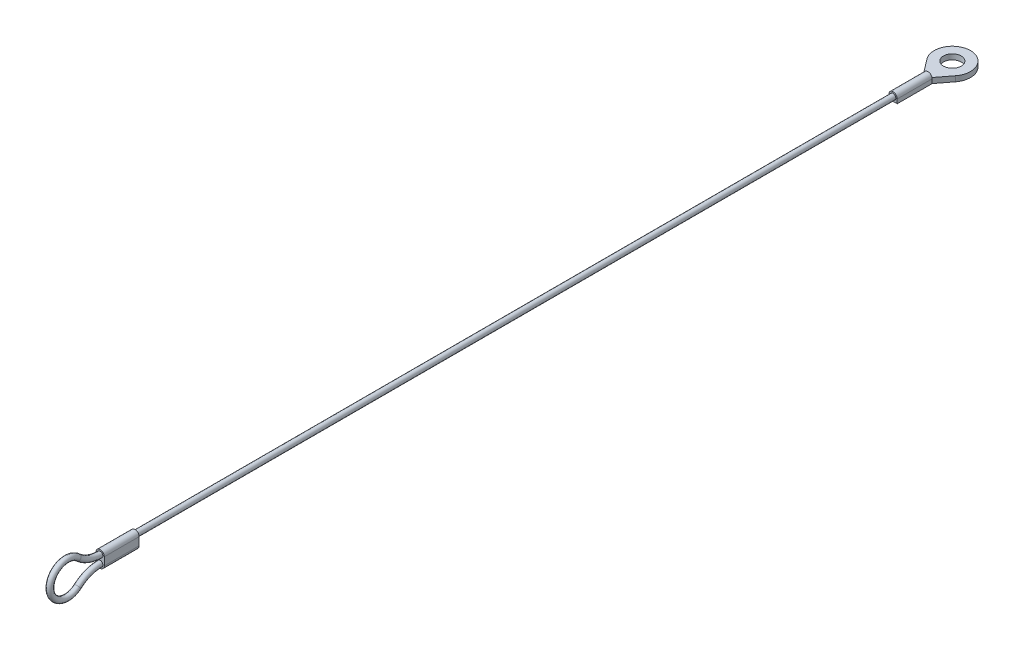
ISO-10303-21;
HEADER;
FILE_DESCRIPTION(('STEP AP214'),'2;1');
FILE_NAME('part.step','',(''),(''),'','','');
FILE_SCHEMA(('AUTOMOTIVE_DESIGN { 1 0 10303 214 1 1 1 1 }'));
ENDSEC;
DATA;
#1=APPLICATION_CONTEXT('core data for automotive mechanical design processes');
#2=APPLICATION_PROTOCOL_DEFINITION('international standard','automotive_design',2000,#1);
#3=PRODUCT_CONTEXT('',#1,'mechanical');
#4=PRODUCT('Part','Part','',(#3));
#5=PRODUCT_RELATED_PRODUCT_CATEGORY('part','',(#4));
#6=PRODUCT_DEFINITION_FORMATION('','',#4);
#7=PRODUCT_DEFINITION_CONTEXT('part definition',#1,'design');
#8=PRODUCT_DEFINITION('design','',#6,#7);
#9=PRODUCT_DEFINITION_SHAPE('','',#8);
#10=(LENGTH_UNIT() NAMED_UNIT(*) SI_UNIT(.MILLI.,.METRE.));
#11=(NAMED_UNIT(*) PLANE_ANGLE_UNIT() SI_UNIT($,.RADIAN.));
#12=(NAMED_UNIT(*) SI_UNIT($,.STERADIAN.) SOLID_ANGLE_UNIT());
#13=UNCERTAINTY_MEASURE_WITH_UNIT(LENGTH_MEASURE(1.E-05),#10,'distance_accuracy_value','');
#14=(GEOMETRIC_REPRESENTATION_CONTEXT(3) GLOBAL_UNCERTAINTY_ASSIGNED_CONTEXT((#13)) GLOBAL_UNIT_ASSIGNED_CONTEXT((#10,
#11,#12)) REPRESENTATION_CONTEXT('',''));
#15=CARTESIAN_POINT('',(0.,0.,0.));
#16=DIRECTION('',(0.,0.,1.));
#17=DIRECTION('',(1.,0.,0.));
#18=AXIS2_PLACEMENT_3D('',#15,#16,#17);
#19=CARTESIAN_POINT('',(0.,0.,-10.));
#20=DIRECTION('',(0.,0.,-1.));
#21=DIRECTION('',(-1.,0.,0.));
#22=AXIS2_PLACEMENT_3D('',#19,#20,#21);
#23=PLANE('',#22);
#24=CARTESIAN_POINT('',(0.,0.,-10.));
#25=DIRECTION('',(0.,0.,-1.));
#26=DIRECTION('',(-1.,0.,0.));
#27=AXIS2_PLACEMENT_3D('',#24,#25,#26);
#28=CIRCLE('',#27,1.195);
#29=CARTESIAN_POINT('',(-1.1499565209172,0.325,-10.));
#30=VERTEX_POINT('',#29);
#31=CARTESIAN_POINT('',(1.1499565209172,0.325,-10.));
#32=VERTEX_POINT('',#31);
#33=EDGE_CURVE('E200',#30,#32,#28,.T.);
#34=ORIENTED_EDGE('',*,*,#33,.T.);
#35=DIRECTION('',(-1.,0.,0.));
#36=VECTOR('',#35,1.);
#37=CARTESIAN_POINT('',(-1.195,0.325,-10.));
#38=LINE('',#37,#36);
#39=EDGE_CURVE('E11',#32,#30,#38,.T.);
#40=ORIENTED_EDGE('',*,*,#39,.T.);
#41=EDGE_LOOP('',(#34,#40));
#42=FACE_BOUND('',#41,.T.);
#43=ADVANCED_FACE('F39',(#42),#23,.T.);
#44=CARTESIAN_POINT('',(0.,0.,227.4));
#45=DIRECTION('',(0.,0.,-1.));
#46=DIRECTION('',(-1.,0.,0.));
#47=AXIS2_PLACEMENT_3D('',#44,#45,#46);
#48=CYLINDRICAL_SURFACE('',#47,0.795);
#49=CARTESIAN_POINT('',(0.,0.,217.4));
#50=DIRECTION('',(0.,0.,-1.));
#51=DIRECTION('',(0.,1.,0.));
#52=AXIS2_PLACEMENT_3D('',#49,#50,#51);
#53=CIRCLE('',#52,0.795);
#54=CARTESIAN_POINT('',(0.,0.795,217.4));
#55=VERTEX_POINT('',#54);
#56=EDGE_CURVE('E43',#55,#55,#53,.T.);
#57=ORIENTED_EDGE('',*,*,#56,.T.);
#58=EDGE_LOOP('',(#57));
#59=FACE_BOUND('',#58,.T.);
#60=CARTESIAN_POINT('',(0.,0.,0.));
#61=DIRECTION('',(0.,0.,1.));
#62=DIRECTION('',(1.,0.,0.));
#63=AXIS2_PLACEMENT_3D('',#60,#61,#62);
#64=CIRCLE('',#63,0.795);
#65=CARTESIAN_POINT('',(0.795,0.,0.));
#66=VERTEX_POINT('',#65);
#67=EDGE_CURVE('E236',#66,#66,#64,.T.);
#68=ORIENTED_EDGE('',*,*,#67,.T.);
#69=EDGE_LOOP('',(#68));
#70=FACE_BOUND('',#69,.T.);
#71=ADVANCED_FACE('F41',(#59,#70),#48,.T.);
#72=CARTESIAN_POINT('',(0.,3.14274069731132E-13,217.4));
#73=DIRECTION('',(0.,0.,1.));
#74=DIRECTION('',(0.,-1.,0.));
#75=AXIS2_PLACEMENT_3D('',#72,#73,#74);
#76=CYLINDRICAL_SURFACE('',#75,1.195);
#77=CARTESIAN_POINT('',(0.,3.28730098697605E-13,227.4));
#78=DIRECTION('',(0.,0.,-1.));
#79=DIRECTION('',(0.,1.,0.));
#80=AXIS2_PLACEMENT_3D('',#77,#78,#79);
#81=CIRCLE('',#80,1.195);
#82=CARTESIAN_POINT('',(-1.195,3.28876443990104E-13,227.4));
#83=VERTEX_POINT('',#82);
#84=CARTESIAN_POINT('',(1.195,3.28583753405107E-13,227.4));
#85=VERTEX_POINT('',#84);
#86=EDGE_CURVE('E248',#83,#85,#81,.T.);
#87=ORIENTED_EDGE('',*,*,#86,.T.);
#88=DIRECTION('',(0.,0.,1.));
#89=VECTOR('',#88,1.);
#90=CARTESIAN_POINT('',(1.195,3.14127724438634E-13,217.4));
#91=LINE('',#90,#89);
#92=CARTESIAN_POINT('',(1.195,3.14127724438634E-13,217.4));
#93=VERTEX_POINT('',#92);
#94=EDGE_CURVE('E269',#93,#85,#91,.T.);
#95=ORIENTED_EDGE('',*,*,#94,.F.);
#96=CARTESIAN_POINT('',(0.,3.14274069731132E-13,217.4));
#97=DIRECTION('',(0.,0.,-1.));
#98=DIRECTION('',(0.,1.,0.));
#99=AXIS2_PLACEMENT_3D('',#96,#97,#98);
#100=CIRCLE('',#99,1.195);
#101=CARTESIAN_POINT('',(-1.195,3.1442041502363E-13,217.4));
#102=VERTEX_POINT('',#101);
#103=EDGE_CURVE('E237',#102,#93,#100,.T.);
#104=ORIENTED_EDGE('',*,*,#103,.F.);
#105=DIRECTION('',(0.,0.,1.));
#106=VECTOR('',#105,1.);
#107=CARTESIAN_POINT('',(-1.195,3.1442041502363E-13,217.4));
#108=LINE('',#107,#106);
#109=EDGE_CURVE('E247',#102,#83,#108,.T.);
#110=ORIENTED_EDGE('',*,*,#109,.T.);
#111=EDGE_LOOP('',(#87,#95,#104,#110));
#112=FACE_BOUND('',#111,.T.);
#113=ADVANCED_FACE('F330',(#112),#76,.T.);
#114=CARTESIAN_POINT('',(1.195,3.14127724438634E-13,217.4));
#115=DIRECTION('',(-1.,0.,0.));
#116=DIRECTION('',(0.,-1.,0.));
#117=AXIS2_PLACEMENT_3D('',#114,#115,#116);
#118=PLANE('',#117);
#119=DIRECTION('',(0.,-1.,0.));
#120=VECTOR('',#119,1.);
#121=CARTESIAN_POINT('',(1.195,3.28583753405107E-13,227.4));
#122=LINE('',#121,#120);
#123=CARTESIAN_POINT('',(1.195,-2.26625258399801,227.4));
#124=VERTEX_POINT('',#123);
#125=EDGE_CURVE('E252',#85,#124,#122,.T.);
#126=ORIENTED_EDGE('',*,*,#125,.T.);
#127=DIRECTION('',(0.,0.,1.));
#128=VECTOR('',#127,1.);
#129=CARTESIAN_POINT('',(1.195,-2.26625258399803,217.4));
#130=LINE('',#129,#128);
#131=CARTESIAN_POINT('',(1.195,-2.26625258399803,217.4));
#132=VERTEX_POINT('',#131);
#133=EDGE_CURVE('E265',#132,#124,#130,.T.);
#134=ORIENTED_EDGE('',*,*,#133,.F.);
#135=DIRECTION('',(0.,-1.,0.));
#136=VECTOR('',#135,1.);
#137=CARTESIAN_POINT('',(1.195,3.14127724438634E-13,217.4));
#138=LINE('',#137,#136);
#139=EDGE_CURVE('E96',#93,#132,#138,.T.);
#140=ORIENTED_EDGE('',*,*,#139,.F.);
#141=ORIENTED_EDGE('',*,*,#94,.T.);
#142=EDGE_LOOP('',(#126,#134,#140,#141));
#143=FACE_BOUND('',#142,.T.);
#144=ADVANCED_FACE('F359',(#143),#118,.F.);
#145=CARTESIAN_POINT('',(0.,-2.26625258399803,217.4));
#146=DIRECTION('',(0.,0.,1.));
#147=DIRECTION('',(0.,-1.,0.));
#148=AXIS2_PLACEMENT_3D('',#145,#146,#147);
#149=CYLINDRICAL_SURFACE('',#148,1.195);
#150=CARTESIAN_POINT('',(0.,-2.26625258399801,227.4));
#151=DIRECTION('',(0.,0.,-1.));
#152=DIRECTION('',(0.,1.,0.));
#153=AXIS2_PLACEMENT_3D('',#150,#151,#152);
#154=CIRCLE('',#153,1.195);
#155=CARTESIAN_POINT('',(-1.195,-2.26625258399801,227.4));
#156=VERTEX_POINT('',#155);
#157=EDGE_CURVE('E255',#124,#156,#154,.T.);
#158=ORIENTED_EDGE('',*,*,#157,.T.);
#159=DIRECTION('',(0.,0.,1.));
#160=VECTOR('',#159,1.);
#161=CARTESIAN_POINT('',(-1.195,-2.26625258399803,217.4));
#162=LINE('',#161,#160);
#163=CARTESIAN_POINT('',(-1.195,-2.26625258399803,217.4));
#164=VERTEX_POINT('',#163);
#165=EDGE_CURVE('E262',#164,#156,#162,.T.);
#166=ORIENTED_EDGE('',*,*,#165,.F.);
#167=CARTESIAN_POINT('',(0.,-2.26625258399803,217.4));
#168=DIRECTION('',(0.,0.,-1.));
#169=DIRECTION('',(0.,1.,0.));
#170=AXIS2_PLACEMENT_3D('',#167,#168,#169);
#171=CIRCLE('',#170,1.195);
#172=EDGE_CURVE('E242',#132,#164,#171,.T.);
#173=ORIENTED_EDGE('',*,*,#172,.F.);
#174=ORIENTED_EDGE('',*,*,#133,.T.);
#175=EDGE_LOOP('',(#158,#166,#173,#174));
#176=FACE_BOUND('',#175,.T.);
#177=ADVANCED_FACE('F356',(#176),#149,.T.);
#178=CARTESIAN_POINT('',(-1.195,3.1442041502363E-13,217.4));
#179=DIRECTION('',(1.,0.,0.));
#180=DIRECTION('',(0.,0.,-1.));
#181=AXIS2_PLACEMENT_3D('',#178,#179,#180);
#182=PLANE('',#181);
#183=DIRECTION('',(0.,1.,0.));
#184=VECTOR('',#183,1.);
#185=CARTESIAN_POINT('',(-1.195,3.28876443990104E-13,227.4));
#186=LINE('',#185,#184);
#187=EDGE_CURVE('E88',#156,#83,#186,.T.);
#188=ORIENTED_EDGE('',*,*,#187,.T.);
#189=ORIENTED_EDGE('',*,*,#109,.F.);
#190=DIRECTION('',(0.,1.,0.));
#191=VECTOR('',#190,1.);
#192=CARTESIAN_POINT('',(-1.195,3.1442041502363E-13,217.4));
#193=LINE('',#192,#191);
#194=EDGE_CURVE('E67',#164,#102,#193,.T.);
#195=ORIENTED_EDGE('',*,*,#194,.F.);
#196=ORIENTED_EDGE('',*,*,#165,.T.);
#197=EDGE_LOOP('',(#188,#189,#195,#196));
#198=FACE_BOUND('',#197,.T.);
#199=ADVANCED_FACE('F348',(#198),#182,.F.);
#200=CARTESIAN_POINT('',(0.,3.14274069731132E-13,217.4));
#201=DIRECTION('',(0.,0.,-1.));
#202=DIRECTION('',(0.,1.,0.));
#203=AXIS2_PLACEMENT_3D('',#200,#201,#202);
#204=PLANE('',#203);
#205=ORIENTED_EDGE('',*,*,#56,.F.);
#206=EDGE_LOOP('',(#205));
#207=FACE_BOUND('',#206,.T.);
#208=ORIENTED_EDGE('',*,*,#103,.T.);
#209=ORIENTED_EDGE('',*,*,#139,.T.);
#210=ORIENTED_EDGE('',*,*,#172,.T.);
#211=ORIENTED_EDGE('',*,*,#194,.T.);
#212=EDGE_LOOP('',(#208,#209,#210,#211));
#213=FACE_BOUND('',#212,.T.);
#214=ADVANCED_FACE('F344',(#207,#213),#204,.T.);
#215=CARTESIAN_POINT('',(0.,3.28730098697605E-13,227.4));
#216=DIRECTION('',(0.,0.,-1.));
#217=DIRECTION('',(0.,1.,0.));
#218=AXIS2_PLACEMENT_3D('',#215,#216,#217);
#219=PLANE('',#218);
#220=CARTESIAN_POINT('',(0.,-2.26625258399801,227.4));
#221=DIRECTION('',(0.,0.,-1.));
#222=DIRECTION('',(1.,0.,0.));
#223=AXIS2_PLACEMENT_3D('',#220,#221,#222);
#224=CIRCLE('',#223,0.795);
#225=CARTESIAN_POINT('',(0.,-1.47125258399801,227.4));
#226=VERTEX_POINT('',#225);
#227=EDGE_CURVE('E276',#226,#226,#224,.T.);
#228=ORIENTED_EDGE('',*,*,#227,.T.);
#229=EDGE_LOOP('',(#228));
#230=FACE_BOUND('',#229,.T.);
#231=CARTESIAN_POINT('',(0.,0.,227.4));
#232=DIRECTION('',(0.,0.,-1.));
#233=DIRECTION('',(0.,1.,0.));
#234=AXIS2_PLACEMENT_3D('',#231,#232,#233);
#235=CIRCLE('',#234,0.795);
#236=CARTESIAN_POINT('',(0.,-0.795000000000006,227.4));
#237=VERTEX_POINT('',#236);
#238=EDGE_CURVE('E272',#237,#237,#235,.T.);
#239=ORIENTED_EDGE('',*,*,#238,.T.);
#240=EDGE_LOOP('',(#239));
#241=FACE_BOUND('',#240,.T.);
#242=ORIENTED_EDGE('',*,*,#86,.F.);
#243=ORIENTED_EDGE('',*,*,#187,.F.);
#244=ORIENTED_EDGE('',*,*,#157,.F.);
#245=ORIENTED_EDGE('',*,*,#125,.F.);
#246=EDGE_LOOP('',(#242,#243,#244,#245));
#247=FACE_BOUND('',#246,.T.);
#248=ADVANCED_FACE('F347',(#230,#241,#247),#219,.F.);
#249=CARTESIAN_POINT('',(0.,-11.866252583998,227.4));
#250=DIRECTION('',(1.,0.,0.));
#251=DIRECTION('',(0.,0.,-1.));
#252=AXIS2_PLACEMENT_3D('',#249,#250,#251);
#253=TOROIDAL_SURFACE('',#252,9.6,0.795);
#254=CARTESIAN_POINT('',(0.,-4.71083505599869,233.8));
#255=DIRECTION('',(0.,0.666666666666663,-0.745355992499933));
#256=DIRECTION('',(1.,0.,0.));
#257=AXIS2_PLACEMENT_3D('',#254,#255,#256);
#258=CIRCLE('',#257,0.795);
#259=CARTESIAN_POINT('',(0.,-4.11827704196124,234.33));
#260=VERTEX_POINT('',#259);
#261=EDGE_CURVE('E279',#260,#260,#258,.T.);
#262=CARTESIAN_POINT('',(0.,-11.866252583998,227.4));
#263=DIRECTION('',(1.,0.,0.));
#264=DIRECTION('',(0.,0.,-1.));
#265=AXIS2_PLACEMENT_3D('',#262,#263,#264);
#266=CIRCLE('',#265,10.395);
#267=EDGE_CURVE('',#226,#260,#266,.T.);
#268=ORIENTED_EDGE('',*,*,#227,.F.);
#269=ORIENTED_EDGE('',*,*,#261,.T.);
#270=ORIENTED_EDGE('',*,*,#267,.T.);
#271=ORIENTED_EDGE('',*,*,#267,.F.);
#272=EDGE_LOOP('',(#268,#270,#269,#271));
#273=FACE_BOUND('',#272,.T.);
#274=ADVANCED_FACE('F352',(#273),#253,.T.);
#275=CARTESIAN_POINT('',(0.,-1.13312629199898,237.));
#276=DIRECTION('',(-1.,0.,0.));
#277=DIRECTION('',(0.,0.,1.));
#278=AXIS2_PLACEMENT_3D('',#275,#276,#277);
#279=TOROIDAL_SURFACE('',#278,4.8,0.795);
#280=CARTESIAN_POINT('',(0.,2.44458247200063,233.8));
#281=DIRECTION('',(0.,0.666666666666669,0.745355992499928));
#282=DIRECTION('',(1.,0.,0.));
#283=AXIS2_PLACEMENT_3D('',#280,#281,#282);
#284=CIRCLE('',#283,0.795);
#285=CARTESIAN_POINT('',(0.,1.85202445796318,234.33));
#286=VERTEX_POINT('',#285);
#287=EDGE_CURVE('E49',#286,#286,#284,.T.);
#288=ORIENTED_EDGE('',*,*,#287,.T.);
#289=EDGE_LOOP('',(#288));
#290=FACE_BOUND('',#289,.T.);
#291=ORIENTED_EDGE('',*,*,#261,.F.);
#292=EDGE_LOOP('',(#291));
#293=FACE_BOUND('',#292,.T.);
#294=ADVANCED_FACE('F368',(#290,#293),#279,.T.);
#295=CARTESIAN_POINT('',(0.,9.6,227.4));
#296=DIRECTION('',(1.,0.,0.));
#297=DIRECTION('',(0.,0.,-1.));
#298=AXIS2_PLACEMENT_3D('',#295,#296,#297);
#299=TOROIDAL_SURFACE('',#298,9.6,0.795);
#300=CARTESIAN_POINT('',(0.,9.6,227.4));
#301=DIRECTION('',(1.,0.,0.));
#302=DIRECTION('',(0.,0.,-1.));
#303=AXIS2_PLACEMENT_3D('',#300,#301,#302);
#304=CIRCLE('',#303,10.395);
#305=EDGE_CURVE('',#286,#237,#304,.T.);
#306=ORIENTED_EDGE('',*,*,#287,.F.);
#307=ORIENTED_EDGE('',*,*,#238,.F.);
#308=ORIENTED_EDGE('',*,*,#305,.T.);
#309=ORIENTED_EDGE('',*,*,#305,.F.);
#310=EDGE_LOOP('',(#306,#308,#307,#309));
#311=FACE_BOUND('',#310,.T.);
#312=ADVANCED_FACE('F343',(#311),#299,.T.);
#313=CARTESIAN_POINT('',(0.,0.,-10.));
#314=DIRECTION('',(0.,0.,1.));
#315=DIRECTION('',(1.,0.,0.));
#316=AXIS2_PLACEMENT_3D('',#313,#314,#315);
#317=CYLINDRICAL_SURFACE('',#316,1.195);
#318=CARTESIAN_POINT('',(0.,0.,0.));
#319=DIRECTION('',(0.,0.,-1.));
#320=DIRECTION('',(-1.,0.,0.));
#321=AXIS2_PLACEMENT_3D('',#318,#319,#320);
#322=CIRCLE('',#321,1.195);
#323=CARTESIAN_POINT('',(-1.195,0.,0.));
#324=VERTEX_POINT('',#323);
#325=CARTESIAN_POINT('',(1.195,0.,0.));
#326=VERTEX_POINT('',#325);
#327=EDGE_CURVE('E189',#324,#326,#322,.T.);
#328=ORIENTED_EDGE('',*,*,#327,.T.);
#329=DIRECTION('',(0.,0.,1.));
#330=VECTOR('',#329,1.);
#331=CARTESIAN_POINT('',(1.195,0.,-10.));
#332=LINE('',#331,#330);
#333=CARTESIAN_POINT('',(1.195,0.,-10.));
#334=VERTEX_POINT('',#333);
#335=EDGE_CURVE('E232',#334,#326,#332,.T.);
#336=ORIENTED_EDGE('',*,*,#335,.F.);
#337=EDGE_CURVE('E201',#32,#334,#28,.T.);
#338=ORIENTED_EDGE('',*,*,#337,.F.);
#339=ORIENTED_EDGE('',*,*,#33,.F.);
#340=CARTESIAN_POINT('',(-1.195,0.,-10.));
#341=VERTEX_POINT('',#340);
#342=EDGE_CURVE('E196',#341,#30,#28,.T.);
#343=ORIENTED_EDGE('',*,*,#342,.F.);
#344=DIRECTION('',(0.,0.,1.));
#345=VECTOR('',#344,1.);
#346=CARTESIAN_POINT('',(-1.195,0.,-10.));
#347=LINE('',#346,#345);
#348=EDGE_CURVE('E207',#341,#324,#347,.T.);
#349=ORIENTED_EDGE('',*,*,#348,.T.);
#350=EDGE_LOOP('',(#328,#336,#338,#339,#343,#349));
#351=FACE_BOUND('',#350,.T.);
#352=ADVANCED_FACE('F301',(#351),#317,.T.);
#353=CARTESIAN_POINT('',(1.195,0.,-10.));
#354=DIRECTION('',(-1.,0.,0.));
#355=DIRECTION('',(0.,-1.,0.));
#356=AXIS2_PLACEMENT_3D('',#353,#354,#355);
#357=PLANE('',#356);
#358=DIRECTION('',(0.,-1.,0.));
#359=VECTOR('',#358,1.);
#360=CARTESIAN_POINT('',(1.195,0.,0.));
#361=LINE('',#360,#359);
#362=CARTESIAN_POINT('',(1.195,-1.195,0.));
#363=VERTEX_POINT('',#362);
#364=EDGE_CURVE('E211',#326,#363,#361,.T.);
#365=ORIENTED_EDGE('',*,*,#364,.T.);
#366=DIRECTION('',(0.,0.,1.));
#367=VECTOR('',#366,1.);
#368=CARTESIAN_POINT('',(1.195,-1.195,-10.));
#369=LINE('',#368,#367);
#370=CARTESIAN_POINT('',(1.195,-1.195,-10.));
#371=VERTEX_POINT('',#370);
#372=EDGE_CURVE('E228',#371,#363,#369,.T.);
#373=ORIENTED_EDGE('',*,*,#372,.F.);
#374=DIRECTION('',(0.,-1.,0.));
#375=VECTOR('',#374,1.);
#376=CARTESIAN_POINT('',(1.195,0.,-10.));
#377=LINE('',#376,#375);
#378=EDGE_CURVE('E199',#334,#371,#377,.T.);
#379=ORIENTED_EDGE('',*,*,#378,.F.);
#380=ORIENTED_EDGE('',*,*,#335,.T.);
#381=EDGE_LOOP('',(#365,#373,#379,#380));
#382=FACE_BOUND('',#381,.T.);
#383=ADVANCED_FACE('F314',(#382),#357,.F.);
#384=CARTESIAN_POINT('',(0.,-1.195,-10.));
#385=DIRECTION('',(0.,1.,0.));
#386=DIRECTION('',(0.,0.,1.));
#387=AXIS2_PLACEMENT_3D('',#384,#385,#386);
#388=PLANE('',#387);
#389=DIRECTION('',(-1.,0.,0.));
#390=VECTOR('',#389,1.);
#391=CARTESIAN_POINT('',(0.,-1.195,0.));
#392=LINE('',#391,#390);
#393=CARTESIAN_POINT('',(-1.195,-1.195,0.));
#394=VERTEX_POINT('',#393);
#395=EDGE_CURVE('E215',#363,#394,#392,.T.);
#396=ORIENTED_EDGE('',*,*,#395,.T.);
#397=DIRECTION('',(0.,0.,1.));
#398=VECTOR('',#397,1.);
#399=CARTESIAN_POINT('',(-1.195,-1.195,-10.));
#400=LINE('',#399,#398);
#401=CARTESIAN_POINT('',(-1.195,-1.195,-10.));
#402=VERTEX_POINT('',#401);
#403=EDGE_CURVE('E224',#402,#394,#400,.T.);
#404=ORIENTED_EDGE('',*,*,#403,.F.);
#405=DIRECTION('',(-0.608040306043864,0.,-0.793906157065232));
#406=VECTOR('',#405,1.);
#407=CARTESIAN_POINT('',(-4.13228154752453,-1.195,-13.8351502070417));
#408=LINE('',#407,#406);
#409=CARTESIAN_POINT('',(-4.13228154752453,-1.195,-13.8351502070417));
#410=VERTEX_POINT('',#409);
#411=EDGE_CURVE('E181',#402,#410,#408,.T.);
#412=ORIENTED_EDGE('',*,*,#411,.T.);
#413=CARTESIAN_POINT('',(0.,-1.195,-17.));
#414=DIRECTION('',(0.,-1.,0.));
#415=DIRECTION('',(0.,0.,1.));
#416=AXIS2_PLACEMENT_3D('',#413,#414,#415);
#417=CIRCLE('',#416,5.205);
#418=CARTESIAN_POINT('',(4.13228154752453,-1.195,-13.8351502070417));
#419=VERTEX_POINT('',#418);
#420=EDGE_CURVE('E147',#410,#419,#417,.T.);
#421=ORIENTED_EDGE('',*,*,#420,.T.);
#422=DIRECTION('',(-0.608040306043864,0.,0.793906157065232));
#423=VECTOR('',#422,1.);
#424=CARTESIAN_POINT('',(1.195,-1.195,-10.));
#425=LINE('',#424,#423);
#426=EDGE_CURVE('E167',#419,#371,#425,.T.);
#427=ORIENTED_EDGE('',*,*,#426,.T.);
#428=ORIENTED_EDGE('',*,*,#372,.T.);
#429=EDGE_LOOP('',(#396,#404,#412,#421,#427,#428));
#430=FACE_BOUND('',#429,.T.);
#431=CARTESIAN_POINT('',(0.,-1.195,-17.));
#432=DIRECTION('',(0.,-1.,0.));
#433=DIRECTION('',(0.,0.,-1.));
#434=AXIS2_PLACEMENT_3D('',#431,#432,#433);
#435=CIRCLE('',#434,2.54);
#436=CARTESIAN_POINT('',(0.,-1.195,-19.54));
#437=VERTEX_POINT('',#436);
#438=EDGE_CURVE('E174',#437,#437,#435,.T.);
#439=ORIENTED_EDGE('',*,*,#438,.F.);
#440=EDGE_LOOP('',(#439));
#441=FACE_BOUND('',#440,.T.);
#442=ADVANCED_FACE('F310',(#430,#441),#388,.F.);
#443=CARTESIAN_POINT('',(-1.195,-1.195,-10.));
#444=DIRECTION('',(1.,0.,0.));
#445=DIRECTION('',(0.,1.,0.));
#446=AXIS2_PLACEMENT_3D('',#443,#444,#445);
#447=PLANE('',#446);
#448=DIRECTION('',(0.,1.,0.));
#449=VECTOR('',#448,1.);
#450=CARTESIAN_POINT('',(-1.195,-1.195,0.));
#451=LINE('',#450,#449);
#452=EDGE_CURVE('E218',#394,#324,#451,.T.);
#453=ORIENTED_EDGE('',*,*,#452,.T.);
#454=ORIENTED_EDGE('',*,*,#348,.F.);
#455=DIRECTION('',(0.,1.,0.));
#456=VECTOR('',#455,1.);
#457=CARTESIAN_POINT('',(-1.195,-1.195,-10.));
#458=LINE('',#457,#456);
#459=EDGE_CURVE('E204',#402,#341,#458,.T.);
#460=ORIENTED_EDGE('',*,*,#459,.F.);
#461=ORIENTED_EDGE('',*,*,#403,.T.);
#462=EDGE_LOOP('',(#453,#454,#460,#461));
#463=FACE_BOUND('',#462,.T.);
#464=ADVANCED_FACE('F295',(#463),#447,.F.);
#465=CARTESIAN_POINT('',(0.,0.,0.));
#466=DIRECTION('',(0.,0.,-1.));
#467=DIRECTION('',(-1.,0.,0.));
#468=AXIS2_PLACEMENT_3D('',#465,#466,#467);
#469=PLANE('',#468);
#470=ORIENTED_EDGE('',*,*,#67,.F.);
#471=EDGE_LOOP('',(#470));
#472=FACE_BOUND('',#471,.T.);
#473=ORIENTED_EDGE('',*,*,#327,.F.);
#474=ORIENTED_EDGE('',*,*,#452,.F.);
#475=ORIENTED_EDGE('',*,*,#395,.F.);
#476=ORIENTED_EDGE('',*,*,#364,.F.);
#477=EDGE_LOOP('',(#473,#474,#475,#476));
#478=FACE_BOUND('',#477,.T.);
#479=ADVANCED_FACE('F291',(#472,#478),#469,.F.);
#480=CARTESIAN_POINT('',(-1.195,0.325,-10.));
#481=DIRECTION('',(0.,0.,1.));
#482=DIRECTION('',(1.,0.,0.));
#483=AXIS2_PLACEMENT_3D('',#480,#481,#482);
#484=PLANE('',#483);
#485=DIRECTION('',(0.,-1.,0.));
#486=VECTOR('',#485,1.);
#487=CARTESIAN_POINT('',(-1.195,0.325,-10.));
#488=LINE('',#487,#486);
#489=CARTESIAN_POINT('',(-1.195,0.325,-10.));
#490=VERTEX_POINT('',#489);
#491=EDGE_CURVE('E165',#490,#341,#488,.T.);
#492=ORIENTED_EDGE('',*,*,#491,.T.);
#493=ORIENTED_EDGE('',*,*,#342,.T.);
#494=EDGE_CURVE('E52',#30,#490,#38,.T.);
#495=ORIENTED_EDGE('',*,*,#494,.T.);
#496=EDGE_LOOP('',(#492,#493,#495));
#497=FACE_BOUND('',#496,.T.);
#498=ADVANCED_FACE('F294',(#497),#484,.T.);
#499=CARTESIAN_POINT('',(-4.13228154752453,0.325,-13.8351502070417));
#500=DIRECTION('',(-0.793906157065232,0.,0.608040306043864));
#501=DIRECTION('',(0.608040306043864,0.,0.793906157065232));
#502=AXIS2_PLACEMENT_3D('',#499,#500,#501);
#503=PLANE('',#502);
#504=ORIENTED_EDGE('',*,*,#411,.F.);
#505=ORIENTED_EDGE('',*,*,#459,.T.);
#506=ORIENTED_EDGE('',*,*,#491,.F.);
#507=DIRECTION('',(-0.608040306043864,0.,-0.793906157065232));
#508=VECTOR('',#507,1.);
#509=CARTESIAN_POINT('',(-4.13228154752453,0.325,-13.8351502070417));
#510=LINE('',#509,#508);
#511=CARTESIAN_POINT('',(-4.13228154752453,0.325,-13.8351502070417));
#512=VERTEX_POINT('',#511);
#513=EDGE_CURVE('E156',#490,#512,#510,.T.);
#514=ORIENTED_EDGE('',*,*,#513,.T.);
#515=DIRECTION('',(0.,-1.,0.));
#516=VECTOR('',#515,1.);
#517=CARTESIAN_POINT('',(-4.13228154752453,0.325,-13.8351502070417));
#518=LINE('',#517,#516);
#519=EDGE_CURVE('E142',#512,#410,#518,.T.);
#520=ORIENTED_EDGE('',*,*,#519,.T.);
#521=EDGE_LOOP('',(#504,#505,#506,#514,#520));
#522=FACE_BOUND('',#521,.T.);
#523=ADVANCED_FACE('F163',(#522),#503,.T.);
#524=CARTESIAN_POINT('',(1.195,0.325,-10.));
#525=VERTEX_POINT('',#524);
#526=EDGE_CURVE('E51',#525,#32,#38,.T.);
#527=ORIENTED_EDGE('',*,*,#526,.T.);
#528=ORIENTED_EDGE('',*,*,#337,.T.);
#529=DIRECTION('',(0.,-1.,0.));
#530=VECTOR('',#529,1.);
#531=CARTESIAN_POINT('',(1.195,0.325,-10.));
#532=LINE('',#531,#530);
#533=EDGE_CURVE('E190',#525,#334,#532,.T.);
#534=ORIENTED_EDGE('',*,*,#533,.F.);
#535=EDGE_LOOP('',(#527,#528,#534));
#536=FACE_BOUND('',#535,.T.);
#537=ADVANCED_FACE('F320',(#536),#484,.T.);
#538=CARTESIAN_POINT('',(1.195,0.325,-10.));
#539=DIRECTION('',(0.793906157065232,0.,0.608040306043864));
#540=DIRECTION('',(0.608040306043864,0.,-0.793906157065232));
#541=AXIS2_PLACEMENT_3D('',#538,#539,#540);
#542=PLANE('',#541);
#543=ORIENTED_EDGE('',*,*,#426,.F.);
#544=DIRECTION('',(0.,-1.,0.));
#545=VECTOR('',#544,1.);
#546=CARTESIAN_POINT('',(4.13228154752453,0.325,-13.8351502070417));
#547=LINE('',#546,#545);
#548=CARTESIAN_POINT('',(4.13228154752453,0.325,-13.8351502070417));
#549=VERTEX_POINT('',#548);
#550=EDGE_CURVE('E152',#549,#419,#547,.T.);
#551=ORIENTED_EDGE('',*,*,#550,.F.);
#552=DIRECTION('',(-0.608040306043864,0.,0.793906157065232));
#553=VECTOR('',#552,1.);
#554=CARTESIAN_POINT('',(1.195,0.325,-10.));
#555=LINE('',#554,#553);
#556=EDGE_CURVE('E159',#549,#525,#555,.T.);
#557=ORIENTED_EDGE('',*,*,#556,.T.);
#558=ORIENTED_EDGE('',*,*,#533,.T.);
#559=ORIENTED_EDGE('',*,*,#378,.T.);
#560=EDGE_LOOP('',(#543,#551,#557,#558,#559));
#561=FACE_BOUND('',#560,.T.);
#562=ADVANCED_FACE('F318',(#561),#542,.T.);
#563=CARTESIAN_POINT('',(0.,0.325,-17.));
#564=DIRECTION('',(0.,-1.,0.));
#565=DIRECTION('',(0.,0.,-1.));
#566=AXIS2_PLACEMENT_3D('',#563,#564,#565);
#567=CYLINDRICAL_SURFACE('',#566,5.205);
#568=ORIENTED_EDGE('',*,*,#420,.F.);
#569=ORIENTED_EDGE('',*,*,#519,.F.);
#570=CARTESIAN_POINT('',(0.,0.325,-17.));
#571=DIRECTION('',(0.,-1.,0.));
#572=DIRECTION('',(0.,0.,1.));
#573=AXIS2_PLACEMENT_3D('',#570,#571,#572);
#574=CIRCLE('',#573,5.205);
#575=EDGE_CURVE('E145',#512,#549,#574,.T.);
#576=ORIENTED_EDGE('',*,*,#575,.T.);
#577=ORIENTED_EDGE('',*,*,#550,.T.);
#578=EDGE_LOOP('',(#568,#569,#576,#577));
#579=FACE_BOUND('',#578,.T.);
#580=ADVANCED_FACE('F144',(#579),#567,.T.);
#581=CARTESIAN_POINT('',(0.,0.325,-17.));
#582=DIRECTION('',(0.,1.,0.));
#583=DIRECTION('',(0.,0.,1.));
#584=AXIS2_PLACEMENT_3D('',#581,#582,#583);
#585=PLANE('',#584);
#586=CARTESIAN_POINT('',(0.,0.325,-17.));
#587=DIRECTION('',(0.,-1.,0.));
#588=DIRECTION('',(0.,0.,-1.));
#589=AXIS2_PLACEMENT_3D('',#586,#587,#588);
#590=CIRCLE('',#589,2.54);
#591=CARTESIAN_POINT('',(0.,0.325,-19.54));
#592=VERTEX_POINT('',#591);
#593=EDGE_CURVE('E184',#592,#592,#590,.T.);
#594=ORIENTED_EDGE('',*,*,#593,.T.);
#595=EDGE_LOOP('',(#594));
#596=FACE_BOUND('',#595,.T.);
#597=ORIENTED_EDGE('',*,*,#513,.F.);
#598=ORIENTED_EDGE('',*,*,#494,.F.);
#599=ORIENTED_EDGE('',*,*,#39,.F.);
#600=ORIENTED_EDGE('',*,*,#526,.F.);
#601=ORIENTED_EDGE('',*,*,#556,.F.);
#602=ORIENTED_EDGE('',*,*,#575,.F.);
#603=EDGE_LOOP('',(#597,#598,#599,#600,#601,#602));
#604=FACE_BOUND('',#603,.T.);
#605=ADVANCED_FACE('F155',(#596,#604),#585,.T.);
#606=CARTESIAN_POINT('',(0.,0.325,-17.));
#607=DIRECTION('',(0.,-1.,0.));
#608=DIRECTION('',(0.,0.,-1.));
#609=AXIS2_PLACEMENT_3D('',#606,#607,#608);
#610=CYLINDRICAL_SURFACE('',#609,2.54);
#611=ORIENTED_EDGE('',*,*,#593,.F.);
#612=EDGE_LOOP('',(#611));
#613=FACE_BOUND('',#612,.T.);
#614=ORIENTED_EDGE('',*,*,#438,.T.);
#615=EDGE_LOOP('',(#614));
#616=FACE_BOUND('',#615,.T.);
#617=ADVANCED_FACE('F436',(#613,#616),#610,.F.);
#618=CLOSED_SHELL('',(#43,#71,#113,#144,#177,#199,#214,#248,#274,#294,#312,#352,#383,#442,#464,
#479,#498,#523,#537,#562,#580,#605,#617));
#619=MANIFOLD_SOLID_BREP('B2',#618);
#620=ADVANCED_BREP_SHAPE_REPRESENTATION('',(#18,#619),#14);
#621=SHAPE_DEFINITION_REPRESENTATION(#9,#620);
ENDSEC;
END-ISO-10303-21;
